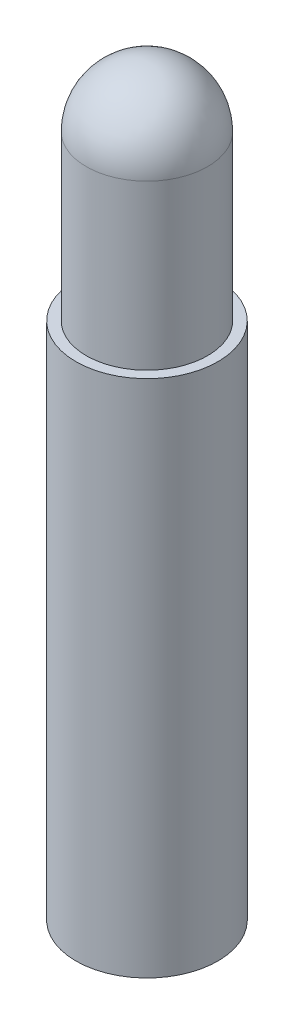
ISO-10303-21;
HEADER;
FILE_DESCRIPTION(('STEP AP214'),'2;1');
FILE_NAME('part.step','',(''),(''),'','','');
FILE_SCHEMA(('AUTOMOTIVE_DESIGN { 1 0 10303 214 1 1 1 1 }'));
ENDSEC;
DATA;
#1=APPLICATION_CONTEXT('core data for automotive mechanical design processes');
#2=APPLICATION_PROTOCOL_DEFINITION('international standard','automotive_design',2000,#1);
#3=PRODUCT_CONTEXT('',#1,'mechanical');
#4=PRODUCT('Part','Part','',(#3));
#5=PRODUCT_RELATED_PRODUCT_CATEGORY('part','',(#4));
#6=PRODUCT_DEFINITION_FORMATION('','',#4);
#7=PRODUCT_DEFINITION_CONTEXT('part definition',#1,'design');
#8=PRODUCT_DEFINITION('design','',#6,#7);
#9=PRODUCT_DEFINITION_SHAPE('','',#8);
#10=(LENGTH_UNIT() NAMED_UNIT(*) SI_UNIT(.MILLI.,.METRE.));
#11=(NAMED_UNIT(*) PLANE_ANGLE_UNIT() SI_UNIT($,.RADIAN.));
#12=(NAMED_UNIT(*) SI_UNIT($,.STERADIAN.) SOLID_ANGLE_UNIT());
#13=UNCERTAINTY_MEASURE_WITH_UNIT(LENGTH_MEASURE(1.E-05),#10,'distance_accuracy_value','');
#14=(GEOMETRIC_REPRESENTATION_CONTEXT(3) GLOBAL_UNCERTAINTY_ASSIGNED_CONTEXT((#13)) GLOBAL_UNIT_ASSIGNED_CONTEXT((#10,
#11,#12)) REPRESENTATION_CONTEXT('',''));
#15=CARTESIAN_POINT('',(0.,0.,0.));
#16=DIRECTION('',(0.,0.,1.));
#17=DIRECTION('',(1.,0.,0.));
#18=AXIS2_PLACEMENT_3D('',#15,#16,#17);
#19=CARTESIAN_POINT('',(0.,-13.0499999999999,0.));
#20=DIRECTION('',(0.,1.,0.));
#21=DIRECTION('',(-0.999589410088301,0.,-0.028653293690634));
#22=AXIS2_PLACEMENT_3D('',#19,#20,#21);
#23=CYLINDRICAL_SURFACE('',#22,5.85);
#24=CARTESIAN_POINT('',(0.,-13.0499999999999,0.));
#25=DIRECTION('',(0.,-1.,0.));
#26=DIRECTION('',(0.999589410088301,0.,0.028653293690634));
#27=AXIS2_PLACEMENT_3D('',#24,#25,#26);
#28=CIRCLE('',#27,5.85);
#29=CARTESIAN_POINT('',(-5.84759804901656,-13.0499999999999,-0.167621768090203));
#30=VERTEX_POINT('',#29);
#31=EDGE_CURVE('E9',#30,#30,#28,.T.);
#32=CARTESIAN_POINT('',(0.,29.7500000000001,0.));
#33=DIRECTION('',(0.,-1.,0.));
#34=DIRECTION('',(0.999589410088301,0.,0.028653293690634));
#35=AXIS2_PLACEMENT_3D('',#32,#33,#34);
#36=CIRCLE('',#35,5.85);
#37=CARTESIAN_POINT('',(-5.84759804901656,29.7500000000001,-0.167621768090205));
#38=VERTEX_POINT('',#37);
#39=EDGE_CURVE('E19',#38,#38,#36,.T.);
#40=CARTESIAN_POINT('',(-5.84759804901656,-13.0499999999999,-0.167621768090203));
#41=CARTESIAN_POINT('',(-5.84759804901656,-12.6041666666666,-0.167621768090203));
#42=CARTESIAN_POINT('',(-5.84759804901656,-12.1583333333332,-0.167621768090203));
#43=CARTESIAN_POINT('',(-5.84759804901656,-11.2666666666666,-0.167621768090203));
#44=CARTESIAN_POINT('',(-5.84759804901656,-10.8208333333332,-0.167621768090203));
#45=CARTESIAN_POINT('',(-5.84759804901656,-9.92916666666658,-0.167621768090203));
#46=CARTESIAN_POINT('',(-5.84759804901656,-9.48333333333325,-0.167621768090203));
#47=CARTESIAN_POINT('',(-5.84759804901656,-8.59166666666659,-0.167621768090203));
#48=CARTESIAN_POINT('',(-5.84759804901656,-8.14583333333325,-0.167621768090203));
#49=CARTESIAN_POINT('',(-5.84759804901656,-7.25416666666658,-0.167621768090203));
#50=CARTESIAN_POINT('',(-5.84759804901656,-6.80833333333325,-0.167621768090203));
#51=CARTESIAN_POINT('',(-5.84759804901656,-5.91666666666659,-0.167621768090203));
#52=CARTESIAN_POINT('',(-5.84759804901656,-5.47083333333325,-0.167621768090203));
#53=CARTESIAN_POINT('',(-5.84759804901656,-4.57916666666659,-0.167621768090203));
#54=CARTESIAN_POINT('',(-5.84759804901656,-4.13333333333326,-0.167621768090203));
#55=CARTESIAN_POINT('',(-5.84759804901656,-3.24166666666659,-0.167621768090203));
#56=CARTESIAN_POINT('',(-5.84759804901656,-2.79583333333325,-0.167621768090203));
#57=CARTESIAN_POINT('',(-5.84759804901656,-1.90416666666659,-0.167621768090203));
#58=CARTESIAN_POINT('',(-5.84759804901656,-1.45833333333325,-0.167621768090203));
#59=CARTESIAN_POINT('',(-5.84759804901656,-0.566666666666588,-0.167621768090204));
#60=CARTESIAN_POINT('',(-5.84759804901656,-0.120833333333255,-0.167621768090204));
#61=CARTESIAN_POINT('',(-5.84759804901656,0.770833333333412,-0.167621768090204));
#62=CARTESIAN_POINT('',(-5.84759804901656,1.21666666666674,-0.167621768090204));
#63=CARTESIAN_POINT('',(-5.84759804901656,2.10833333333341,-0.167621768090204));
#64=CARTESIAN_POINT('',(-5.84759804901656,2.55416666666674,-0.167621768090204));
#65=CARTESIAN_POINT('',(-5.84759804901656,3.44583333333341,-0.167621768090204));
#66=CARTESIAN_POINT('',(-5.84759804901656,3.89166666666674,-0.167621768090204));
#67=CARTESIAN_POINT('',(-5.84759804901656,4.78333333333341,-0.167621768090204));
#68=CARTESIAN_POINT('',(-5.84759804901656,5.22916666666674,-0.167621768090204));
#69=CARTESIAN_POINT('',(-5.84759804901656,6.12083333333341,-0.167621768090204));
#70=CARTESIAN_POINT('',(-5.84759804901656,6.56666666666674,-0.167621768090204));
#71=CARTESIAN_POINT('',(-5.84759804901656,7.45833333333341,-0.167621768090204));
#72=CARTESIAN_POINT('',(-5.84759804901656,7.90416666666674,-0.167621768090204));
#73=CARTESIAN_POINT('',(-5.84759804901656,8.79583333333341,-0.167621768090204));
#74=CARTESIAN_POINT('',(-5.84759804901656,9.24166666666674,-0.167621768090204));
#75=CARTESIAN_POINT('',(-5.84759804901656,10.1333333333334,-0.167621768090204));
#76=CARTESIAN_POINT('',(-5.84759804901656,10.5791666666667,-0.167621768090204));
#77=CARTESIAN_POINT('',(-5.84759804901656,11.4708333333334,-0.167621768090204));
#78=CARTESIAN_POINT('',(-5.84759804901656,11.9166666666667,-0.167621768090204));
#79=CARTESIAN_POINT('',(-5.84759804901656,12.8083333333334,-0.167621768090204));
#80=CARTESIAN_POINT('',(-5.84759804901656,13.2541666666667,-0.167621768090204));
#81=CARTESIAN_POINT('',(-5.84759804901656,14.1458333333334,-0.167621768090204));
#82=CARTESIAN_POINT('',(-5.84759804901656,14.5916666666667,-0.167621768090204));
#83=CARTESIAN_POINT('',(-5.84759804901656,15.4833333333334,-0.167621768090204));
#84=CARTESIAN_POINT('',(-5.84759804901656,15.9291666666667,-0.167621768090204));
#85=CARTESIAN_POINT('',(-5.84759804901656,16.8208333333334,-0.167621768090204));
#86=CARTESIAN_POINT('',(-5.84759804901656,17.2666666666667,-0.167621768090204));
#87=CARTESIAN_POINT('',(-5.84759804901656,18.1583333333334,-0.167621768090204));
#88=CARTESIAN_POINT('',(-5.84759804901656,18.6041666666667,-0.167621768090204));
#89=CARTESIAN_POINT('',(-5.84759804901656,19.4958333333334,-0.167621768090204));
#90=CARTESIAN_POINT('',(-5.84759804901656,19.9416666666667,-0.167621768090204));
#91=CARTESIAN_POINT('',(-5.84759804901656,20.8333333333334,-0.167621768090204));
#92=CARTESIAN_POINT('',(-5.84759804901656,21.2791666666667,-0.167621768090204));
#93=CARTESIAN_POINT('',(-5.84759804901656,22.1708333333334,-0.167621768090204));
#94=CARTESIAN_POINT('',(-5.84759804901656,22.6166666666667,-0.167621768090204));
#95=CARTESIAN_POINT('',(-5.84759804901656,23.5083333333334,-0.167621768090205));
#96=CARTESIAN_POINT('',(-5.84759804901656,23.9541666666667,-0.167621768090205));
#97=CARTESIAN_POINT('',(-5.84759804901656,24.8458333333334,-0.167621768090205));
#98=CARTESIAN_POINT('',(-5.84759804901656,25.2916666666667,-0.167621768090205));
#99=CARTESIAN_POINT('',(-5.84759804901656,26.1833333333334,-0.167621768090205));
#100=CARTESIAN_POINT('',(-5.84759804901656,26.6291666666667,-0.167621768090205));
#101=CARTESIAN_POINT('',(-5.84759804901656,27.5208333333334,-0.167621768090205));
#102=CARTESIAN_POINT('',(-5.84759804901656,27.9666666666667,-0.167621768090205));
#103=CARTESIAN_POINT('',(-5.84759804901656,28.8583333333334,-0.167621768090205));
#104=CARTESIAN_POINT('',(-5.84759804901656,29.3041666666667,-0.167621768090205));
#105=CARTESIAN_POINT('',(-5.84759804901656,29.7500000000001,-0.167621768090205));
#106=B_SPLINE_CURVE_WITH_KNOTS('',3,(#40,#41,#42,#43,#44,#45,#46,#47,#48,#49,#50,#51,#52,#53,
#54,#55,#56,#57,#58,#59,#60,#61,#62,#63,#64,#65,#66,#67,#68,#69,#70,#71,#72,#73,#74,#75,#76,#77,
#78,#79,#80,#81,#82,#83,#84,#85,#86,#87,#88,#89,#90,#91,#92,#93,#94,#95,#96,#97,#98,#99,#100,
#101,#102,#103,#104,#105),.UNSPECIFIED.,.F.,.F.,(4,2,2,2,2,2,2,2,2,2,2,2,2,2,2,2,2,2,2,2,2,2,2,
2,2,2,2,2,2,2,2,2,4),(0.,1.3375,2.675,4.0125,5.35,6.6875,8.025,9.3625,10.7,12.0375,13.375,
14.7125,16.05,17.3875,18.725,20.0625,21.4,22.7375,24.075,25.4125,26.75,28.0875,29.425,30.7625,
32.1,33.4375,34.775,36.1125,37.45,38.7875,40.125,41.4625,42.8),.UNSPECIFIED.);
#107=EDGE_CURVE('BSEAM13',#30,#38,#106,.T.);
#108=ORIENTED_EDGE('',*,*,#31,.F.);
#109=ORIENTED_EDGE('',*,*,#39,.T.);
#110=ORIENTED_EDGE('',*,*,#107,.T.);
#111=ORIENTED_EDGE('',*,*,#107,.F.);
#112=EDGE_LOOP('',(#108,#110,#109,#111));
#113=FACE_BOUND('',#112,.T.);
#114=ADVANCED_FACE('F13',(#113),#23,.T.);
#115=CARTESIAN_POINT('',(0.,-13.0499999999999,0.));
#116=DIRECTION('',(0.,-1.,0.));
#117=DIRECTION('',(0.999589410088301,0.,0.028653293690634));
#118=AXIS2_PLACEMENT_3D('',#115,#116,#117);
#119=PLANE('',#118);
#120=ORIENTED_EDGE('',*,*,#31,.T.);
#121=EDGE_LOOP('',(#120));
#122=FACE_BOUND('',#121,.T.);
#123=ADVANCED_FACE('F47',(#122),#119,.T.);
#124=CARTESIAN_POINT('',(0.,29.7500000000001,0.));
#125=DIRECTION('',(0.,-1.,0.));
#126=DIRECTION('',(0.999589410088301,0.,0.028653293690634));
#127=AXIS2_PLACEMENT_3D('',#124,#125,#126);
#128=PLANE('',#127);
#129=CARTESIAN_POINT('',(0.,29.7500000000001,0.));
#130=DIRECTION('',(0.,-1.,0.));
#131=DIRECTION('',(-0.440625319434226,0.,-0.89769110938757));
#132=AXIS2_PLACEMENT_3D('',#129,#130,#131);
#133=CIRCLE('',#132,5.);
#134=CARTESIAN_POINT('',(-2.20312659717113,29.7500000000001,-4.48845554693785));
#135=VERTEX_POINT('',#134);
#136=EDGE_CURVE('E23',#135,#135,#133,.T.);
#137=ORIENTED_EDGE('',*,*,#136,.T.);
#138=EDGE_LOOP('',(#137));
#139=FACE_BOUND('',#138,.T.);
#140=ORIENTED_EDGE('',*,*,#39,.F.);
#141=EDGE_LOOP('',(#140));
#142=FACE_BOUND('',#141,.T.);
#143=ADVANCED_FACE('F44',(#139,#142),#128,.F.);
#144=CARTESIAN_POINT('',(0.,23.7500000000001,0.));
#145=DIRECTION('',(0.,-1.,0.));
#146=DIRECTION('',(-0.440625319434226,0.,-0.89769110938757));
#147=AXIS2_PLACEMENT_3D('',#144,#145,#146);
#148=CYLINDRICAL_SURFACE('',#147,5.);
#149=CARTESIAN_POINT('',(0.,43.2500000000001,0.));
#150=DIRECTION('',(0.,-1.,0.));
#151=DIRECTION('',(-0.440625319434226,0.,-0.89769110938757));
#152=AXIS2_PLACEMENT_3D('',#149,#150,#151);
#153=CIRCLE('',#152,5.);
#154=CARTESIAN_POINT('',(-2.20312659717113,43.2500000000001,-4.48845554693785));
#155=VERTEX_POINT('',#154);
#156=EDGE_CURVE('E27',#155,#155,#153,.T.);
#157=ORIENTED_EDGE('',*,*,#156,.T.);
#158=EDGE_LOOP('',(#157));
#159=FACE_BOUND('',#158,.T.);
#160=ORIENTED_EDGE('',*,*,#136,.F.);
#161=EDGE_LOOP('',(#160));
#162=FACE_BOUND('',#161,.T.);
#163=ADVANCED_FACE('F33',(#159,#162),#148,.T.);
#164=CARTESIAN_POINT('',(0.,43.2500000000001,0.));
#165=DIRECTION('',(0.,-1.,0.));
#166=DIRECTION('',(0.89769110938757,0.,-0.440625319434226));
#167=AXIS2_PLACEMENT_3D('',#164,#165,#166);
#168=SPHERICAL_SURFACE('',#167,5.);
#169=ORIENTED_EDGE('',*,*,#156,.F.);
#170=EDGE_LOOP('',(#169));
#171=FACE_BOUND('',#170,.T.);
#172=ADVANCED_FACE('F36',(#171),#168,.T.);
#173=CLOSED_SHELL('',(#114,#123,#143,#163,#172));
#174=MANIFOLD_SOLID_BREP('B1',#173);
#175=ADVANCED_BREP_SHAPE_REPRESENTATION('',(#18,#174),#14);
#176=SHAPE_DEFINITION_REPRESENTATION(#9,#175);
ENDSEC;
END-ISO-10303-21;
